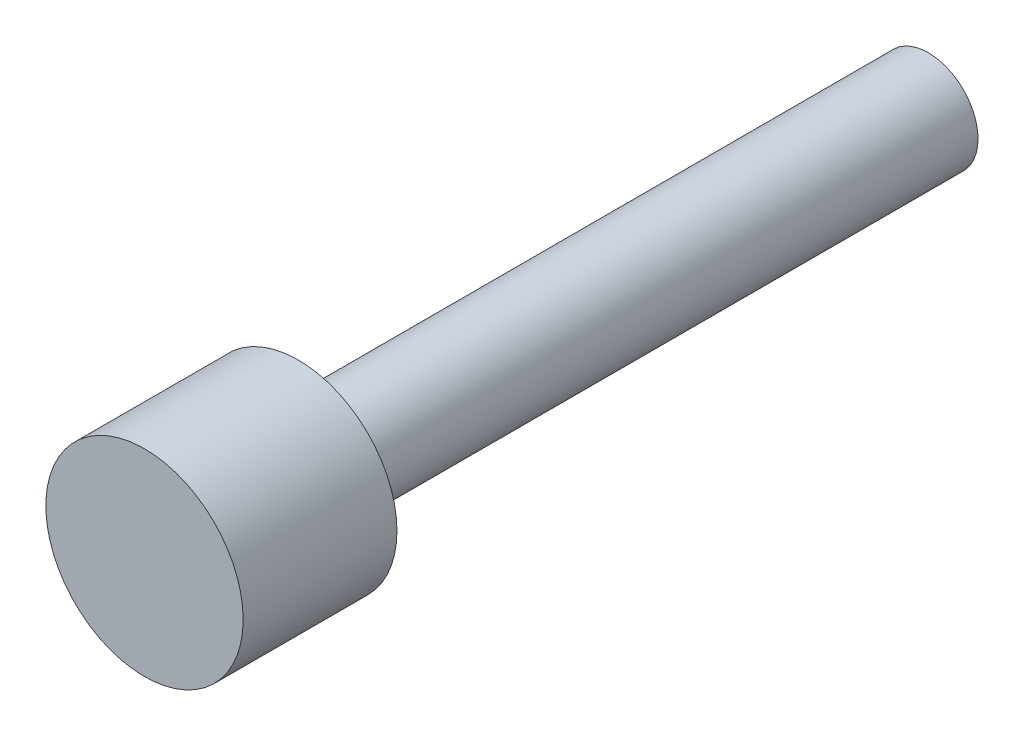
from build123d import *

# Parameters (mm, degrees)
SKETCH1_R           = 7.14375
BOSS_EXTRUDE1_DEPTH = 11.134725
SKETCH2_R           = 3.59537
BOSS_EXTRUDE2_DEPTH = 45.6184


with BuildPart() as part:
    # Sketch1 → Boss-Extrude1 (new body)
    with BuildSketch(Plane.XY):
        Circle(SKETCH1_R)
    extrude(amount=-BOSS_EXTRUDE1_DEPTH)

    # Sketch2 → Boss-Extrude2 (add)
    with BuildSketch(Plane(origin=(0, 0, -11.134725), x_dir=(-1, 0, 0), z_dir=(0, 0, -1))):
        with Locations(Location((0, 0, 0), (0, 0, 90))):
            Circle(SKETCH2_R)
    extrude(amount=BOSS_EXTRUDE2_DEPTH)


solid = part.part
